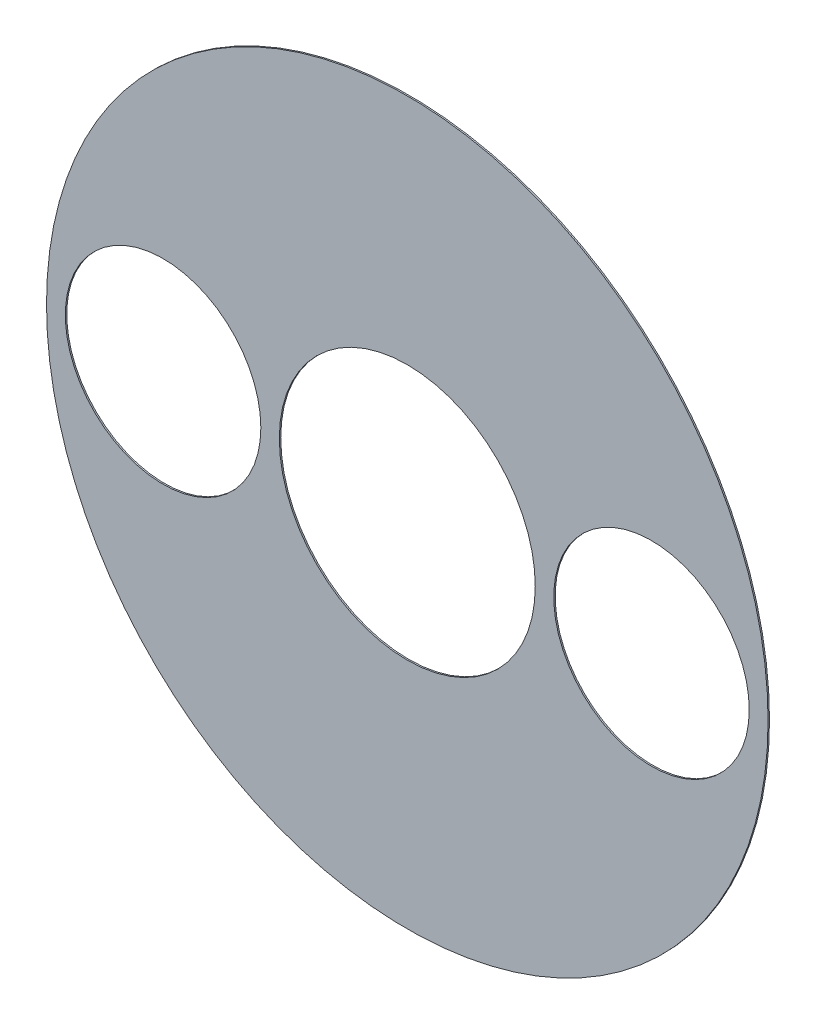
ISO-10303-21;
HEADER;
FILE_DESCRIPTION(('STEP AP214'),'2;1');
FILE_NAME('part.step','',(''),(''),'','','');
FILE_SCHEMA(('AUTOMOTIVE_DESIGN { 1 0 10303 214 1 1 1 1 }'));
ENDSEC;
DATA;
#1=APPLICATION_CONTEXT('core data for automotive mechanical design processes');
#2=APPLICATION_PROTOCOL_DEFINITION('international standard','automotive_design',2000,#1);
#3=PRODUCT_CONTEXT('',#1,'mechanical');
#4=PRODUCT('Part','Part','',(#3));
#5=PRODUCT_RELATED_PRODUCT_CATEGORY('part','',(#4));
#6=PRODUCT_DEFINITION_FORMATION('','',#4);
#7=PRODUCT_DEFINITION_CONTEXT('part definition',#1,'design');
#8=PRODUCT_DEFINITION('design','',#6,#7);
#9=PRODUCT_DEFINITION_SHAPE('','',#8);
#10=(LENGTH_UNIT() NAMED_UNIT(*) SI_UNIT(.MILLI.,.METRE.));
#11=(NAMED_UNIT(*) PLANE_ANGLE_UNIT() SI_UNIT($,.RADIAN.));
#12=(NAMED_UNIT(*) SI_UNIT($,.STERADIAN.) SOLID_ANGLE_UNIT());
#13=UNCERTAINTY_MEASURE_WITH_UNIT(LENGTH_MEASURE(1.E-05),#10,'distance_accuracy_value','');
#14=(GEOMETRIC_REPRESENTATION_CONTEXT(3) GLOBAL_UNCERTAINTY_ASSIGNED_CONTEXT((#13)) GLOBAL_UNIT_ASSIGNED_CONTEXT((#10,
#11,#12)) REPRESENTATION_CONTEXT('',''));
#15=CARTESIAN_POINT('',(0.,0.,0.));
#16=DIRECTION('',(0.,0.,1.));
#17=DIRECTION('',(1.,0.,0.));
#18=AXIS2_PLACEMENT_3D('',#15,#16,#17);
#19=CARTESIAN_POINT('',(0.,0.,-2.));
#20=DIRECTION('',(0.,0.,1.));
#21=DIRECTION('',(1.,0.,0.));
#22=AXIS2_PLACEMENT_3D('',#19,#20,#21);
#23=CYLINDRICAL_SURFACE('',#22,507.5);
#24=CARTESIAN_POINT('',(0.,0.,-2.));
#25=DIRECTION('',(0.,0.,1.));
#26=DIRECTION('',(1.,0.,0.));
#27=AXIS2_PLACEMENT_3D('',#24,#25,#26);
#28=CIRCLE('',#27,507.5);
#29=CARTESIAN_POINT('',(507.5,0.,-2.));
#30=VERTEX_POINT('',#29);
#31=EDGE_CURVE('E10',#30,#30,#28,.T.);
#32=ORIENTED_EDGE('',*,*,#31,.T.);
#33=EDGE_LOOP('',(#32));
#34=FACE_BOUND('',#33,.T.);
#35=CARTESIAN_POINT('',(0.,0.,0.));
#36=DIRECTION('',(0.,0.,1.));
#37=DIRECTION('',(1.,0.,0.));
#38=AXIS2_PLACEMENT_3D('',#35,#36,#37);
#39=CIRCLE('',#38,507.5);
#40=CARTESIAN_POINT('',(507.5,0.,0.));
#41=VERTEX_POINT('',#40);
#42=EDGE_CURVE('E39',#41,#41,#39,.T.);
#43=ORIENTED_EDGE('',*,*,#42,.F.);
#44=EDGE_LOOP('',(#43));
#45=FACE_BOUND('',#44,.T.);
#46=ADVANCED_FACE('F36',(#34,#45),#23,.T.);
#47=CARTESIAN_POINT('',(0.,0.,-2.));
#48=DIRECTION('',(0.,0.,1.));
#49=DIRECTION('',(1.,0.,0.));
#50=AXIS2_PLACEMENT_3D('',#47,#48,#49);
#51=PLANE('',#50);
#52=CARTESIAN_POINT('',(-343.5,0.,-2.));
#53=DIRECTION('',(0.,0.,1.));
#54=DIRECTION('',(1.,0.,0.));
#55=AXIS2_PLACEMENT_3D('',#52,#53,#54);
#56=CIRCLE('',#55,137.5);
#57=CARTESIAN_POINT('',(-206.,0.,-2.));
#58=VERTEX_POINT('',#57);
#59=EDGE_CURVE('E59',#58,#58,#56,.T.);
#60=ORIENTED_EDGE('',*,*,#59,.T.);
#61=EDGE_LOOP('',(#60));
#62=FACE_BOUND('',#61,.T.);
#63=CARTESIAN_POINT('',(0.,0.,-2.));
#64=DIRECTION('',(0.,0.,1.));
#65=DIRECTION('',(1.,0.,0.));
#66=AXIS2_PLACEMENT_3D('',#63,#64,#65);
#67=CIRCLE('',#66,180.);
#68=CARTESIAN_POINT('',(180.,0.,-2.));
#69=VERTEX_POINT('',#68);
#70=EDGE_CURVE('E53',#69,#69,#67,.T.);
#71=ORIENTED_EDGE('',*,*,#70,.T.);
#72=EDGE_LOOP('',(#71));
#73=FACE_BOUND('',#72,.T.);
#74=CARTESIAN_POINT('',(343.5,0.,-2.));
#75=DIRECTION('',(0.,0.,1.));
#76=DIRECTION('',(1.,0.,0.));
#77=AXIS2_PLACEMENT_3D('',#74,#75,#76);
#78=CIRCLE('',#77,137.5);
#79=CARTESIAN_POINT('',(481.,0.,-2.));
#80=VERTEX_POINT('',#79);
#81=EDGE_CURVE('E46',#80,#80,#78,.T.);
#82=ORIENTED_EDGE('',*,*,#81,.T.);
#83=EDGE_LOOP('',(#82));
#84=FACE_BOUND('',#83,.T.);
#85=ORIENTED_EDGE('',*,*,#31,.F.);
#86=EDGE_LOOP('',(#85));
#87=FACE_BOUND('',#86,.T.);
#88=ADVANCED_FACE('F73',(#62,#73,#84,#87),#51,.F.);
#89=CARTESIAN_POINT('',(0.,0.,0.));
#90=DIRECTION('',(0.,0.,1.));
#91=DIRECTION('',(1.,0.,0.));
#92=AXIS2_PLACEMENT_3D('',#89,#90,#91);
#93=PLANE('',#92);
#94=CARTESIAN_POINT('',(-343.5,0.,0.));
#95=DIRECTION('',(0.,0.,1.));
#96=DIRECTION('',(1.,0.,0.));
#97=AXIS2_PLACEMENT_3D('',#94,#95,#96);
#98=CIRCLE('',#97,137.5);
#99=CARTESIAN_POINT('',(-206.,0.,0.));
#100=VERTEX_POINT('',#99);
#101=EDGE_CURVE('E62',#100,#100,#98,.T.);
#102=ORIENTED_EDGE('',*,*,#101,.F.);
#103=EDGE_LOOP('',(#102));
#104=FACE_BOUND('',#103,.T.);
#105=CARTESIAN_POINT('',(0.,0.,0.));
#106=DIRECTION('',(0.,0.,1.));
#107=DIRECTION('',(1.,0.,0.));
#108=AXIS2_PLACEMENT_3D('',#105,#106,#107);
#109=CIRCLE('',#108,180.);
#110=CARTESIAN_POINT('',(180.,0.,0.));
#111=VERTEX_POINT('',#110);
#112=EDGE_CURVE('E56',#111,#111,#109,.T.);
#113=ORIENTED_EDGE('',*,*,#112,.F.);
#114=EDGE_LOOP('',(#113));
#115=FACE_BOUND('',#114,.T.);
#116=CARTESIAN_POINT('',(343.5,0.,0.));
#117=DIRECTION('',(0.,0.,1.));
#118=DIRECTION('',(1.,0.,0.));
#119=AXIS2_PLACEMENT_3D('',#116,#117,#118);
#120=CIRCLE('',#119,137.5);
#121=CARTESIAN_POINT('',(481.,0.,0.));
#122=VERTEX_POINT('',#121);
#123=EDGE_CURVE('E50',#122,#122,#120,.T.);
#124=ORIENTED_EDGE('',*,*,#123,.F.);
#125=EDGE_LOOP('',(#124));
#126=FACE_BOUND('',#125,.T.);
#127=ORIENTED_EDGE('',*,*,#42,.T.);
#128=EDGE_LOOP('',(#127));
#129=FACE_BOUND('',#128,.T.);
#130=ADVANCED_FACE('F69',(#104,#115,#126,#129),#93,.T.);
#131=CARTESIAN_POINT('',(343.5,0.,-10.));
#132=DIRECTION('',(0.,0.,1.));
#133=DIRECTION('',(1.,0.,0.));
#134=AXIS2_PLACEMENT_3D('',#131,#132,#133);
#135=CYLINDRICAL_SURFACE('',#134,137.5);
#136=ORIENTED_EDGE('',*,*,#123,.T.);
#137=EDGE_LOOP('',(#136));
#138=FACE_BOUND('',#137,.T.);
#139=ORIENTED_EDGE('',*,*,#81,.F.);
#140=EDGE_LOOP('',(#139));
#141=FACE_BOUND('',#140,.T.);
#142=ADVANCED_FACE('F72',(#138,#141),#135,.F.);
#143=CARTESIAN_POINT('',(0.,0.,-10.));
#144=DIRECTION('',(0.,0.,1.));
#145=DIRECTION('',(1.,0.,0.));
#146=AXIS2_PLACEMENT_3D('',#143,#144,#145);
#147=CYLINDRICAL_SURFACE('',#146,180.);
#148=ORIENTED_EDGE('',*,*,#112,.T.);
#149=EDGE_LOOP('',(#148));
#150=FACE_BOUND('',#149,.T.);
#151=ORIENTED_EDGE('',*,*,#70,.F.);
#152=EDGE_LOOP('',(#151));
#153=FACE_BOUND('',#152,.T.);
#154=ADVANCED_FACE('F92',(#150,#153),#147,.F.);
#155=CARTESIAN_POINT('',(-343.5,0.,-10.));
#156=DIRECTION('',(0.,0.,1.));
#157=DIRECTION('',(1.,0.,0.));
#158=AXIS2_PLACEMENT_3D('',#155,#156,#157);
#159=CYLINDRICAL_SURFACE('',#158,137.5);
#160=ORIENTED_EDGE('',*,*,#101,.T.);
#161=EDGE_LOOP('',(#160));
#162=FACE_BOUND('',#161,.T.);
#163=ORIENTED_EDGE('',*,*,#59,.F.);
#164=EDGE_LOOP('',(#163));
#165=FACE_BOUND('',#164,.T.);
#166=ADVANCED_FACE('F66',(#162,#165),#159,.F.);
#167=CLOSED_SHELL('',(#46,#88,#130,#142,#154,#166));
#168=MANIFOLD_SOLID_BREP('B2',#167);
#169=ADVANCED_BREP_SHAPE_REPRESENTATION('',(#18,#168),#14);
#170=SHAPE_DEFINITION_REPRESENTATION(#9,#169);
ENDSEC;
END-ISO-10303-21;
